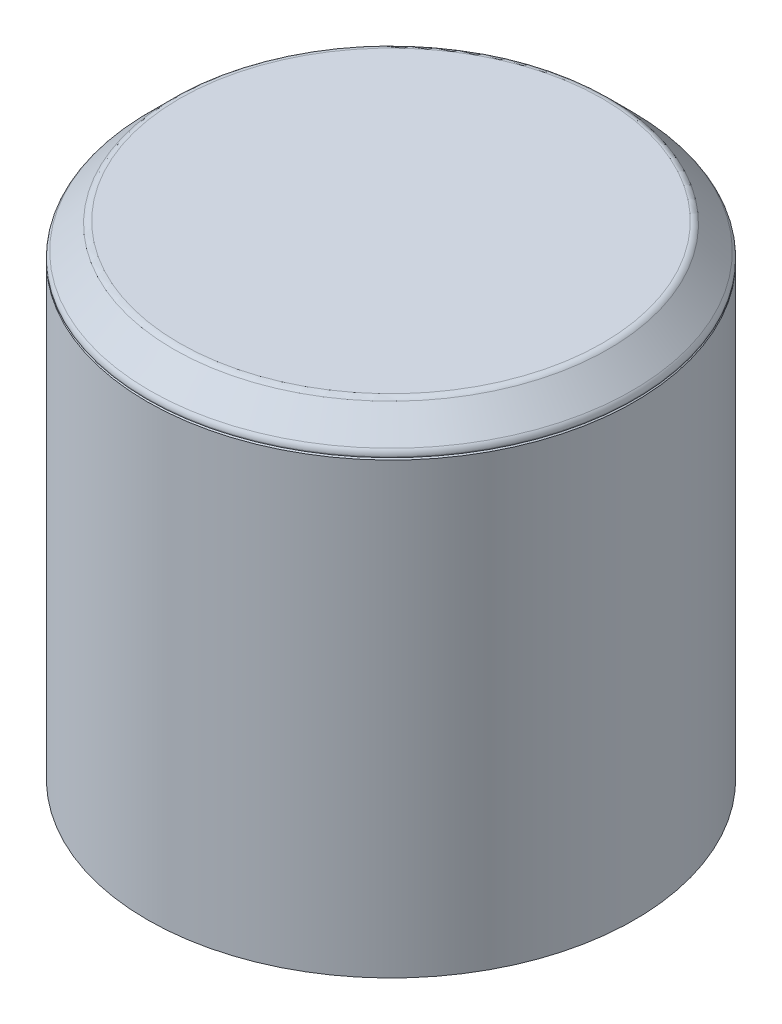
from build123d import *

# Parameters (mm, degrees)
IZIM1_W                     = 59.5
IZIM1_H                     = 110
IZIM1_W_2                   = 45
IZIM1_H_2                   = 7
IZIM2_R                     = 59.5
Y_KSEKLIK_EKSTR_ZYON1_DEPTH = 8
PAH1_SIZE                   = 0.5
PAH2_SIZE                   = 7
RADYUS1_R                   = 2


with BuildPart() as part:
    # izim1 → D_nd_r1 (revolve)
    with BuildSketch(Plane(origin=(0, 0, 0), x_dir=(0, 0, -1), z_dir=(1, 0, 0)), mode=Mode.PRIVATE) as d_nd_r1_sk:
        with Locations((-29.75, 55)):
            Rectangle(IZIM1_W, IZIM1_H)
        with Locations((-22.5, -3.5)):
            Rectangle(IZIM1_W_2, IZIM1_H_2)
    revolve(d_nd_r1_sk.sketch.rotate(Axis((0, 0, 0), (0, 1, 0)), 180), axis=Axis((0, 0, 0), (0, 1, 0)))

    # Pah1
    pah1_edges = [part.edges().sort_by_distance(p)[0] for p in [
        (0, 110, 59.5),
    ]]
    chamfer(pah1_edges, length=PAH1_SIZE)


with BuildPart() as body_2:
    # izim2 → Y_kseklik-Ekstr_zyon1 (new body)
    with BuildSketch(Plane(origin=(0, 110, 0), x_dir=(1, 0, 0), z_dir=(0, 1, 0))):
        with Locations(Location((0, 0, 0), (0, 0, 270))):
            Circle(IZIM2_R)
    extrude(amount=Y_KSEKLIK_EKSTR_ZYON1_DEPTH)

    # Pah2
    pah2_edges = [body_2.edges().sort_by_distance(p)[0] for p in [
        (0, 118, -59.5),
    ]]
    chamfer(pah2_edges, length=PAH2_SIZE)

    # Radyus1
    radyus1_edges = [body_2.edges().sort_by_distance(p)[0] for p in [
        (0, 118, -52.5),
        (0, 111, -59.5),
    ]]
    fillet(radyus1_edges, radius=RADYUS1_R)


solid = Compound([part.part, body_2.part])
